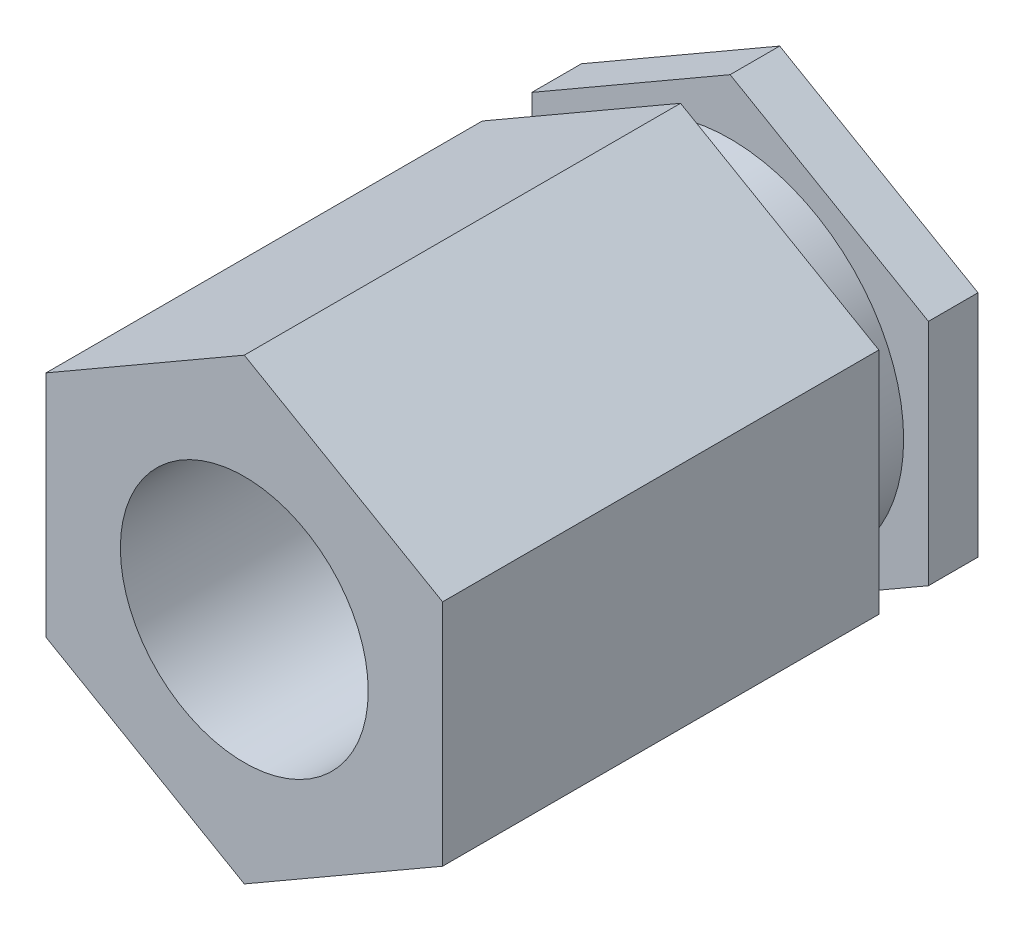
from build123d import *

# Parameters (mm, degrees)
ESQUISSE1_R          = 2.5
BASE_EXTRUSION_DEPTH = 10.8
ESQUISSE2_W          = 1
ESQUISSE2_H          = 1.880954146


with BuildPart() as part:
    # Esquisse1 → Base-Extrusion (new body)
    with BuildSketch(Plane.XY):
        Polygon((0, 4.618802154), (-4, 2.309401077), (-4, -2.309401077), (0, -4.618802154), (4, -2.309401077), (4, 2.309401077), align=None)
        Circle(ESQUISSE1_R, mode=Mode.SUBTRACT)
    extrude(amount=-BASE_EXTRUSION_DEPTH)

    # Esquisse2 → Enl_vement de mati_re-R_volution1 (revolve, cut)
    with BuildSketch(Plane(origin=(0, 0, 0), x_dir=(0, 0, -1), z_dir=(1, 0, 0)), mode=Mode.PRIVATE) as enl_vement_de_mati_re_r_volution1_sk:
        with Locations((9.3, 4.440477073)):
            Rectangle(ESQUISSE2_W, ESQUISSE2_H)
    revolve(enl_vement_de_mati_re_r_volution1_sk.sketch.rotate(Axis((0, 0, 0.507779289), (0, 0, -1)), 90), axis=Axis((0, 0, 0.507779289), (0, 0, -1)), mode=Mode.SUBTRACT)


solid = part.part
